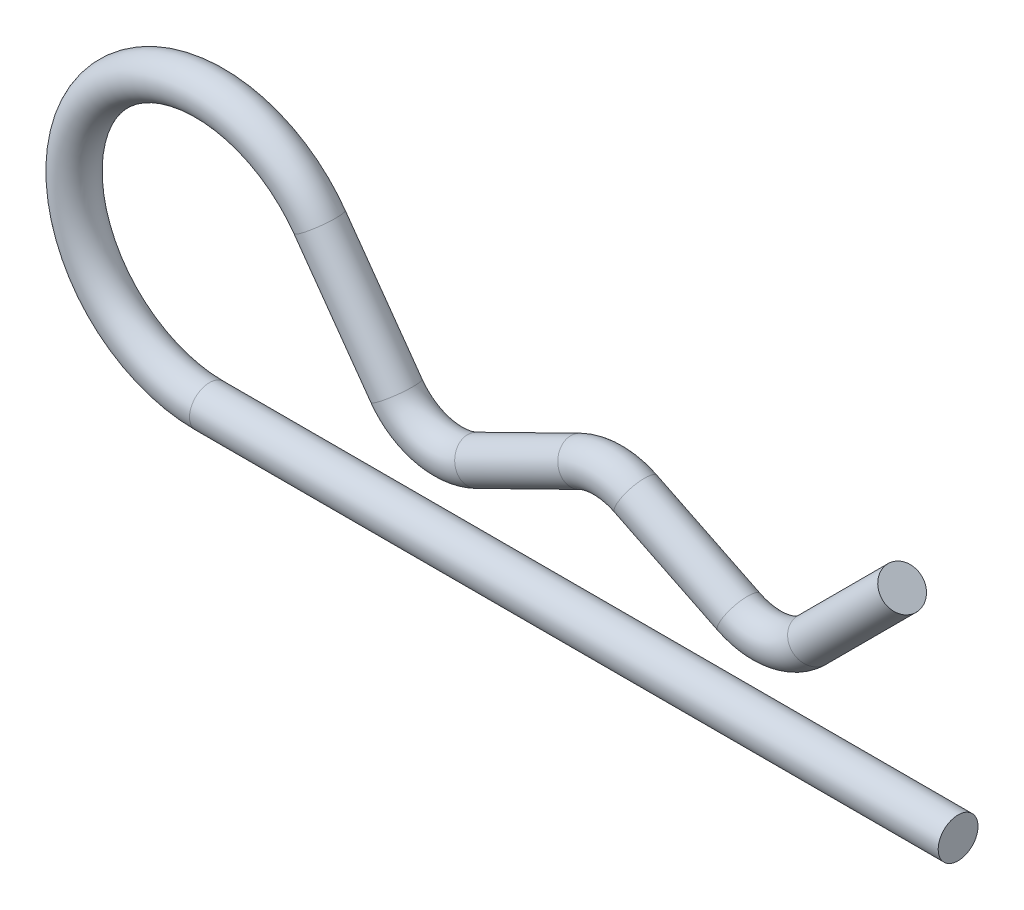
ISO-10303-21;
HEADER;
FILE_DESCRIPTION(('STEP AP214'),'2;1');
FILE_NAME('part.step','',(''),(''),'','','');
FILE_SCHEMA(('AUTOMOTIVE_DESIGN { 1 0 10303 214 1 1 1 1 }'));
ENDSEC;
DATA;
#1=APPLICATION_CONTEXT('core data for automotive mechanical design processes');
#2=APPLICATION_PROTOCOL_DEFINITION('international standard','automotive_design',2000,#1);
#3=PRODUCT_CONTEXT('',#1,'mechanical');
#4=PRODUCT('Part','Part','',(#3));
#5=PRODUCT_RELATED_PRODUCT_CATEGORY('part','',(#4));
#6=PRODUCT_DEFINITION_FORMATION('','',#4);
#7=PRODUCT_DEFINITION_CONTEXT('part definition',#1,'design');
#8=PRODUCT_DEFINITION('design','',#6,#7);
#9=PRODUCT_DEFINITION_SHAPE('','',#8);
#10=(LENGTH_UNIT() NAMED_UNIT(*) SI_UNIT(.MILLI.,.METRE.));
#11=(NAMED_UNIT(*) PLANE_ANGLE_UNIT() SI_UNIT($,.RADIAN.));
#12=(NAMED_UNIT(*) SI_UNIT($,.STERADIAN.) SOLID_ANGLE_UNIT());
#13=UNCERTAINTY_MEASURE_WITH_UNIT(LENGTH_MEASURE(1.E-05),#10,'distance_accuracy_value','');
#14=(GEOMETRIC_REPRESENTATION_CONTEXT(3) GLOBAL_UNCERTAINTY_ASSIGNED_CONTEXT((#13)) GLOBAL_UNIT_ASSIGNED_CONTEXT((#10,
#11,#12)) REPRESENTATION_CONTEXT('',''));
#15=CARTESIAN_POINT('',(0.,0.,0.));
#16=DIRECTION('',(0.,0.,1.));
#17=DIRECTION('',(1.,0.,0.));
#18=AXIS2_PLACEMENT_3D('',#15,#16,#17);
#19=CARTESIAN_POINT('',(8.485281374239,2.828427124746,0.));
#20=DIRECTION('',(0.707106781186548,0.707106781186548,0.));
#21=DIRECTION('',(-0.707106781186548,0.707106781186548,0.));
#22=AXIS2_PLACEMENT_3D('',#19,#20,#21);
#23=PLANE('',#22);
#24=CARTESIAN_POINT('',(8.4852813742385,2.8284271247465,0.));
#25=DIRECTION('',(0.707106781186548,0.707106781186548,0.));
#26=DIRECTION('',(-0.707106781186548,0.707106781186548,0.));
#27=AXIS2_PLACEMENT_3D('',#24,#25,#26);
#28=CIRCLE('',#27,1.25);
#29=CARTESIAN_POINT('',(7.60139789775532,3.71231060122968,0.));
#30=VERTEX_POINT('',#29);
#31=EDGE_CURVE('E43',#30,#30,#28,.F.);
#32=ORIENTED_EDGE('',*,*,#31,.F.);
#33=EDGE_LOOP('',(#32));
#34=FACE_BOUND('',#33,.T.);
#35=ADVANCED_FACE('F40',(#34),#23,.T.);
#36=CARTESIAN_POINT('',(2.828427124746,-2.828427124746,0.));
#37=DIRECTION('',(0.707106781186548,0.707106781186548,0.));
#38=DIRECTION('',(-0.707106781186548,0.707106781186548,0.));
#39=AXIS2_PLACEMENT_3D('',#36,#37,#38);
#40=CYLINDRICAL_SURFACE('',#39,1.25);
#41=ORIENTED_EDGE('',*,*,#31,.T.);
#42=EDGE_LOOP('',(#41));
#43=FACE_BOUND('',#42,.T.);
#44=CARTESIAN_POINT('',(2.82842712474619,-2.82842712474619,0.));
#45=DIRECTION('',(0.707106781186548,0.707106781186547,0.));
#46=DIRECTION('',(0.707106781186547,-0.707106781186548,0.));
#47=AXIS2_PLACEMENT_3D('',#44,#45,#46);
#48=CIRCLE('',#47,1.25);
#49=CARTESIAN_POINT('',(3.71231060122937,-3.71231060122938,0.));
#50=VERTEX_POINT('',#49);
#51=EDGE_CURVE('E111',#50,#50,#48,.F.);
#52=ORIENTED_EDGE('',*,*,#51,.F.);
#53=EDGE_LOOP('',(#52));
#54=FACE_BOUND('',#53,.T.);
#55=ADVANCED_FACE('F107',(#43,#54),#40,.T.);
#56=CARTESIAN_POINT('',(0.,0.,0.));
#57=DIRECTION('',(0.,0.,1.));
#58=DIRECTION('',(0.440996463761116,0.897508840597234,0.));
#59=AXIS2_PLACEMENT_3D('',#56,#57,#58);
#60=TOROIDAL_SURFACE('',#59,4.,1.25);
#61=ORIENTED_EDGE('',*,*,#51,.T.);
#62=EDGE_LOOP('',(#61));
#63=FACE_BOUND('',#62,.T.);
#64=CARTESIAN_POINT('',(-1.76398585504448,-3.5900353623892,0.));
#65=DIRECTION('',(0.897508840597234,-0.440996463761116,0.));
#66=DIRECTION('',(0.440996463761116,0.897508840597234,0.));
#67=AXIS2_PLACEMENT_3D('',#64,#65,#66);
#68=CIRCLE('',#67,1.25);
#69=CARTESIAN_POINT('',(-1.21274027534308,-2.46814931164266,0.));
#70=VERTEX_POINT('',#69);
#71=EDGE_CURVE('E110',#70,#70,#68,.F.);
#72=ORIENTED_EDGE('',*,*,#71,.F.);
#73=EDGE_LOOP('',(#72));
#74=FACE_BOUND('',#73,.T.);
#75=ADVANCED_FACE('F103',(#63,#74),#60,.T.);
#76=CARTESIAN_POINT('',(-8.236014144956,-0.409964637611,0.));
#77=DIRECTION('',(0.897508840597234,-0.440996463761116,0.));
#78=DIRECTION('',(0.440996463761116,0.897508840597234,0.));
#79=AXIS2_PLACEMENT_3D('',#76,#77,#78);
#80=CYLINDRICAL_SURFACE('',#79,1.25);
#81=ORIENTED_EDGE('',*,*,#71,.T.);
#82=EDGE_LOOP('',(#81));
#83=FACE_BOUND('',#82,.T.);
#84=CARTESIAN_POINT('',(-8.23601414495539,-0.409964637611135,0.));
#85=DIRECTION('',(0.897508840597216,-0.440996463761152,0.));
#86=DIRECTION('',(0.440996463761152,0.897508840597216,0.));
#87=AXIS2_PLACEMENT_3D('',#84,#85,#86);
#88=CIRCLE('',#87,1.25);
#89=CARTESIAN_POINT('',(-7.68476856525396,0.711921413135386,0.));
#90=VERTEX_POINT('',#89);
#91=EDGE_CURVE('E92',#90,#90,#88,.F.);
#92=ORIENTED_EDGE('',*,*,#91,.F.);
#93=EDGE_LOOP('',(#92));
#94=FACE_BOUND('',#93,.T.);
#95=ADVANCED_FACE('F99',(#83,#94),#80,.T.);
#96=CARTESIAN_POINT('',(-10.,-4.,0.));
#97=DIRECTION('',(0.,0.,-1.));
#98=DIRECTION('',(0.440996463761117,-0.897508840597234,0.));
#99=AXIS2_PLACEMENT_3D('',#96,#97,#98);
#100=TOROIDAL_SURFACE('',#99,4.,1.25);
#101=ORIENTED_EDGE('',*,*,#91,.T.);
#102=EDGE_LOOP('',(#101));
#103=FACE_BOUND('',#102,.T.);
#104=CARTESIAN_POINT('',(-11.763985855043,-0.409964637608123,0.));
#105=DIRECTION('',(0.897508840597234,0.440996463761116,0.));
#106=DIRECTION('',(-0.440996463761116,0.897508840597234,0.));
#107=AXIS2_PLACEMENT_3D('',#104,#105,#106);
#108=CIRCLE('',#107,1.25);
#109=CARTESIAN_POINT('',(-12.3152314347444,0.711921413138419,0.));
#110=VERTEX_POINT('',#109);
#111=EDGE_CURVE('E88',#110,#110,#108,.F.);
#112=ORIENTED_EDGE('',*,*,#111,.F.);
#113=EDGE_LOOP('',(#112));
#114=FACE_BOUND('',#113,.T.);
#115=ADVANCED_FACE('F96',(#103,#114),#100,.T.);
#116=CARTESIAN_POINT('',(-18.23601414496,-3.590035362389,0.));
#117=DIRECTION('',(0.897508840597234,0.440996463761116,0.));
#118=DIRECTION('',(-0.440996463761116,0.897508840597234,0.));
#119=AXIS2_PLACEMENT_3D('',#116,#117,#118);
#120=CYLINDRICAL_SURFACE('',#119,1.25);
#121=ORIENTED_EDGE('',*,*,#111,.T.);
#122=EDGE_LOOP('',(#121));
#123=FACE_BOUND('',#122,.T.);
#124=CARTESIAN_POINT('',(-18.2360141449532,-3.59003536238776,0.));
#125=DIRECTION('',(0.897508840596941,0.440996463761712,0.));
#126=DIRECTION('',(0.440996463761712,-0.897508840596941,0.));
#127=AXIS2_PLACEMENT_3D('',#124,#125,#126);
#128=CIRCLE('',#127,1.25);
#129=CARTESIAN_POINT('',(-17.684768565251,-4.71192141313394,0.));
#130=VERTEX_POINT('',#129);
#131=EDGE_CURVE('E84',#130,#130,#128,.F.);
#132=ORIENTED_EDGE('',*,*,#131,.F.);
#133=EDGE_LOOP('',(#132));
#134=FACE_BOUND('',#133,.T.);
#135=ADVANCED_FACE('F79',(#123,#134),#120,.T.);
#136=CARTESIAN_POINT('',(-20.,0.,0.));
#137=DIRECTION('',(0.,0.,1.));
#138=DIRECTION('',(0.813969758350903,0.580907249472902,0.));
#139=AXIS2_PLACEMENT_3D('',#136,#137,#138);
#140=TOROIDAL_SURFACE('',#139,4.,1.25);
#141=ORIENTED_EDGE('',*,*,#131,.T.);
#142=EDGE_LOOP('',(#141));
#143=FACE_BOUND('',#142,.T.);
#144=CARTESIAN_POINT('',(-23.2558790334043,-2.32362899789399,0.));
#145=DIRECTION('',(0.580907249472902,-0.813969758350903,0.));
#146=DIRECTION('',(0.813969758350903,0.580907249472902,0.));
#147=AXIS2_PLACEMENT_3D('',#144,#145,#146);
#148=CIRCLE('',#147,1.25);
#149=CARTESIAN_POINT('',(-22.2384168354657,-1.59749493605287,0.));
#150=VERTEX_POINT('',#149);
#151=EDGE_CURVE('E56',#150,#150,#148,.F.);
#152=ORIENTED_EDGE('',*,*,#151,.F.);
#153=EDGE_LOOP('',(#152));
#154=FACE_BOUND('',#153,.T.);
#155=ADVANCED_FACE('F74',(#143,#154),#140,.T.);
#156=CARTESIAN_POINT('',(-28.08125705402,4.43771162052,0.));
#157=DIRECTION('',(0.580907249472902,-0.813969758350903,0.));
#158=DIRECTION('',(0.813969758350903,0.580907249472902,0.));
#159=AXIS2_PLACEMENT_3D('',#156,#157,#158);
#160=CYLINDRICAL_SURFACE('',#159,1.25);
#161=ORIENTED_EDGE('',*,*,#151,.T.);
#162=EDGE_LOOP('',(#161));
#163=FACE_BOUND('',#162,.T.);
#164=CARTESIAN_POINT('',(-28.0812570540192,4.43771162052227,0.));
#165=DIRECTION('',(0.580907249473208,-0.813969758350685,0.));
#166=DIRECTION('',(0.813969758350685,0.580907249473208,0.));
#167=AXIS2_PLACEMENT_3D('',#164,#165,#166);
#168=CIRCLE('',#167,1.25);
#169=CARTESIAN_POINT('',(-27.0637948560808,5.16384568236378,0.));
#170=VERTEX_POINT('',#169);
#171=EDGE_CURVE('E48',#170,#170,#168,.F.);
#172=ORIENTED_EDGE('',*,*,#171,.F.);
#173=EDGE_LOOP('',(#172));
#174=FACE_BOUND('',#173,.T.);
#175=ADVANCED_FACE('F69',(#163,#174),#160,.T.);
#176=CARTESIAN_POINT('',(-35.,-0.5,0.));
#177=DIRECTION('',(0.,0.,-1.));
#178=DIRECTION('',(0.,1.,0.));
#179=AXIS2_PLACEMENT_3D('',#176,#177,#178);
#180=TOROIDAL_SURFACE('',#179,8.5,1.25);
#181=ORIENTED_EDGE('',*,*,#171,.T.);
#182=EDGE_LOOP('',(#181));
#183=FACE_BOUND('',#182,.T.);
#184=CARTESIAN_POINT('',(-35.,-9.,0.));
#185=DIRECTION('',(-1.,0.,0.));
#186=DIRECTION('',(0.,0.,1.));
#187=AXIS2_PLACEMENT_3D('',#184,#185,#186);
#188=CIRCLE('',#187,1.25);
#189=CARTESIAN_POINT('',(-35.,-9.,1.25));
#190=VERTEX_POINT('',#189);
#191=EDGE_CURVE('E11',#190,#190,#188,.F.);
#192=ORIENTED_EDGE('',*,*,#191,.F.);
#193=EDGE_LOOP('',(#192));
#194=FACE_BOUND('',#193,.T.);
#195=ADVANCED_FACE('F64',(#183,#194),#180,.T.);
#196=CARTESIAN_POINT('',(12.,-9.,0.));
#197=DIRECTION('',(-1.,0.,0.));
#198=DIRECTION('',(0.,0.,1.));
#199=AXIS2_PLACEMENT_3D('',#196,#197,#198);
#200=CYLINDRICAL_SURFACE('',#199,1.25);
#201=CARTESIAN_POINT('',(12.,-9.,0.));
#202=DIRECTION('',(1.,0.,0.));
#203=DIRECTION('',(0.,0.,-1.));
#204=AXIS2_PLACEMENT_3D('',#201,#202,#203);
#205=CIRCLE('',#204,1.25);
#206=CARTESIAN_POINT('',(12.,-9.,-1.25));
#207=VERTEX_POINT('',#206);
#208=EDGE_CURVE('E60',#207,#207,#205,.T.);
#209=ORIENTED_EDGE('',*,*,#208,.F.);
#210=EDGE_LOOP('',(#209));
#211=FACE_BOUND('',#210,.T.);
#212=ORIENTED_EDGE('',*,*,#191,.T.);
#213=EDGE_LOOP('',(#212));
#214=FACE_BOUND('',#213,.T.);
#215=ADVANCED_FACE('F68',(#211,#214),#200,.T.);
#216=CARTESIAN_POINT('',(12.,-9.,0.));
#217=DIRECTION('',(1.,0.,0.));
#218=DIRECTION('',(0.,0.,-1.));
#219=AXIS2_PLACEMENT_3D('',#216,#217,#218);
#220=PLANE('',#219);
#221=ORIENTED_EDGE('',*,*,#208,.T.);
#222=EDGE_LOOP('',(#221));
#223=FACE_BOUND('',#222,.T.);
#224=ADVANCED_FACE('F126',(#223),#220,.T.);
#225=CLOSED_SHELL('',(#35,#55,#75,#95,#115,#135,#155,#175,#195,#215,#224));
#226=MANIFOLD_SOLID_BREP('B2',#225);
#227=ADVANCED_BREP_SHAPE_REPRESENTATION('',(#18,#226),#14);
#228=SHAPE_DEFINITION_REPRESENTATION(#9,#227);
ENDSEC;
END-ISO-10303-21;
